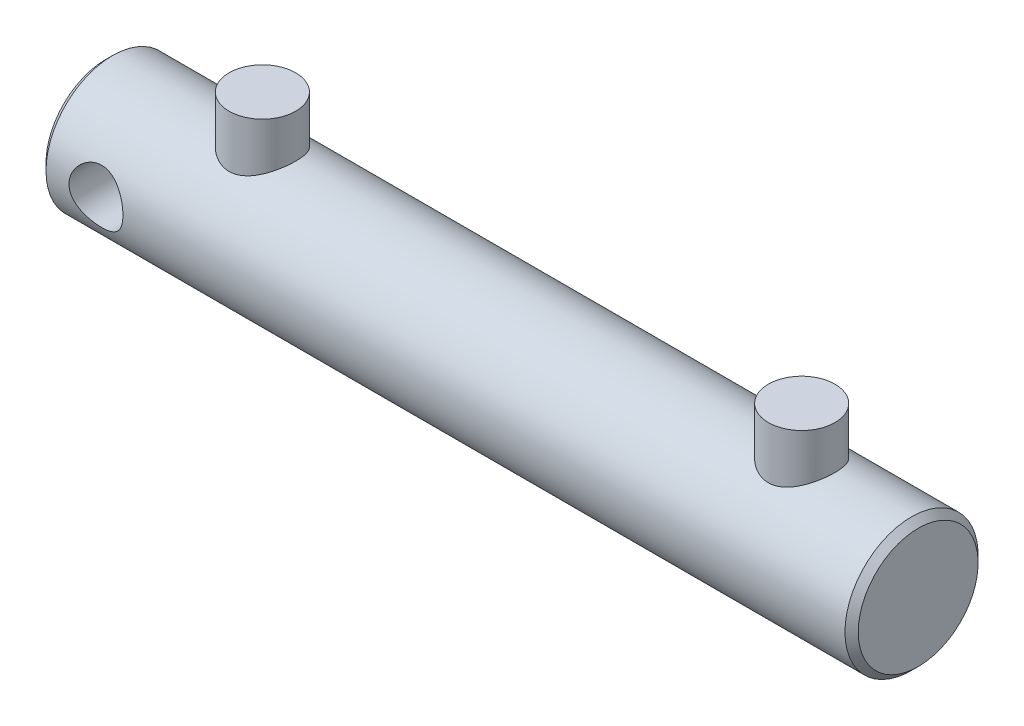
from build123d import *

# Parameters (mm, degrees)
ESQUISSE1_W                  = 244
ESQUISSE1_H                  = 20
CHANFREIN1_SIZE              = 2
ENL_V_MAT_EXTRU_1_DEPTH      = 126.235777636
ENL_V_MAT_EXTRU_1_DEPTH_BACK = 126.235777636
ESQUISSE3_R                  = 8.1
ESQUISSE5_R                  = 10
EXTRUSION2_DEPTH             = 33


with BuildPart() as part:
    # Esquisse1 → R_volution1 (revolve)
    with BuildSketch(Plane.XY, mode=Mode.PRIVATE) as r_volution1_sk:
        with Locations((0, 10)):
            Rectangle(ESQUISSE1_W, ESQUISSE1_H)
    revolve(r_volution1_sk.sketch.rotate(Axis((-122, 0, 0), (1, 0, 0)), 90), axis=Axis((-122, 0, 0), (1, 0, 0)))

    # Chanfrein1
    chanfrein1_edges = [part.edges().sort_by_distance(p)[0] for p in [
        (122, 0, -20),
        (-122, 0, -20),
    ]]
    chamfer(chanfrein1_edges, length=CHANFREIN1_SIZE)

    # Esquisse3 → Enl_v. mat.-Extru.1 (cut, two sides: drawn at the far end of the back side and taken through both)
    with BuildSketch(Plane.XY.offset(-ENL_V_MAT_EXTRU_1_DEPTH_BACK)):
        with Locations((-105, 0)):
            Circle(ESQUISSE3_R)
    extrude(amount=ENL_V_MAT_EXTRU_1_DEPTH + ENL_V_MAT_EXTRU_1_DEPTH_BACK, mode=Mode.SUBTRACT)

    # Esquisse5 → Extrusion2 (add)
    with BuildSketch(Plane(origin=(0, 0, 0), x_dir=(1, 0, 0), z_dir=(0, 1, 0))):
        with Locations(Location((-75, 0, 0), (0, 0, 90))):
            Circle(ESQUISSE5_R)
        with Locations(Location((87, 0, 0), (0, 0, 90))):
            Circle(ESQUISSE5_R)
    extrude(amount=EXTRUSION2_DEPTH)


solid = part.part
